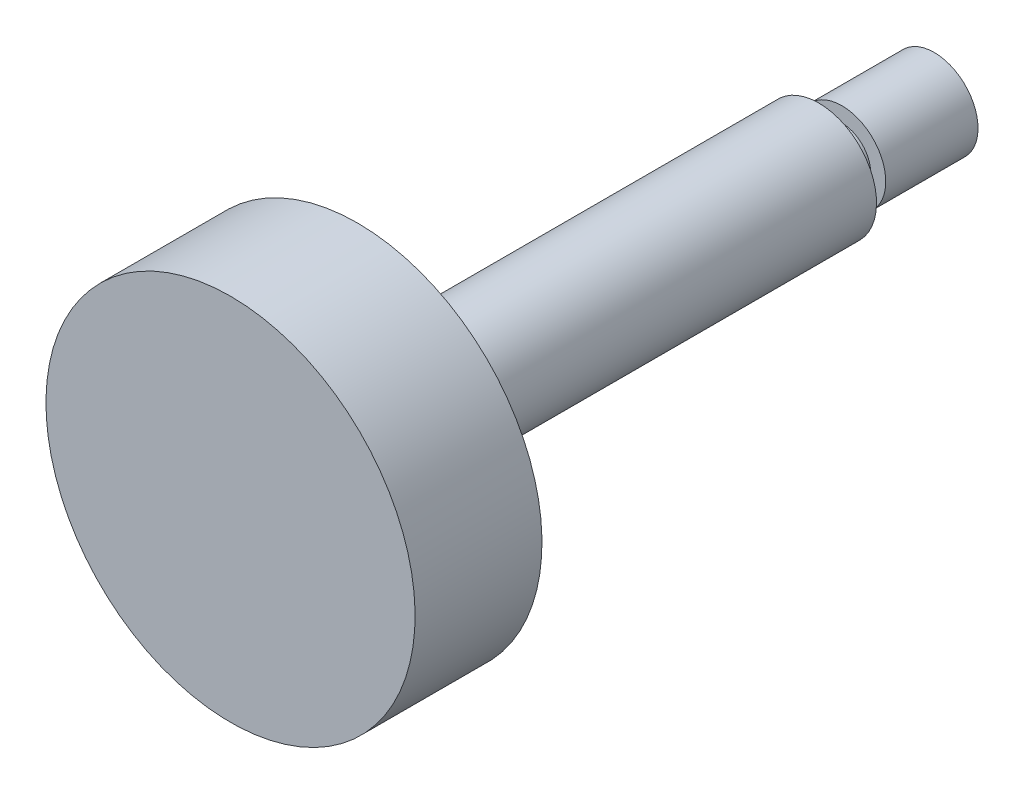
ISO-10303-21;
HEADER;
FILE_DESCRIPTION(('STEP AP214'),'2;1');
FILE_NAME('part.step','',(''),(''),'','','');
FILE_SCHEMA(('AUTOMOTIVE_DESIGN { 1 0 10303 214 1 1 1 1 }'));
ENDSEC;
DATA;
#1=APPLICATION_CONTEXT('core data for automotive mechanical design processes');
#2=APPLICATION_PROTOCOL_DEFINITION('international standard','automotive_design',2000,#1);
#3=PRODUCT_CONTEXT('',#1,'mechanical');
#4=PRODUCT('Part','Part','',(#3));
#5=PRODUCT_RELATED_PRODUCT_CATEGORY('part','',(#4));
#6=PRODUCT_DEFINITION_FORMATION('','',#4);
#7=PRODUCT_DEFINITION_CONTEXT('part definition',#1,'design');
#8=PRODUCT_DEFINITION('design','',#6,#7);
#9=PRODUCT_DEFINITION_SHAPE('','',#8);
#10=(LENGTH_UNIT() NAMED_UNIT(*) SI_UNIT(.MILLI.,.METRE.));
#11=(NAMED_UNIT(*) PLANE_ANGLE_UNIT() SI_UNIT($,.RADIAN.));
#12=(NAMED_UNIT(*) SI_UNIT($,.STERADIAN.) SOLID_ANGLE_UNIT());
#13=UNCERTAINTY_MEASURE_WITH_UNIT(LENGTH_MEASURE(1.E-05),#10,'distance_accuracy_value','');
#14=(GEOMETRIC_REPRESENTATION_CONTEXT(3) GLOBAL_UNCERTAINTY_ASSIGNED_CONTEXT((#13)) GLOBAL_UNIT_ASSIGNED_CONTEXT((#10,
#11,#12)) REPRESENTATION_CONTEXT('',''));
#15=CARTESIAN_POINT('',(0.,0.,0.));
#16=DIRECTION('',(0.,0.,1.));
#17=DIRECTION('',(1.,0.,0.));
#18=AXIS2_PLACEMENT_3D('',#15,#16,#17);
#19=CARTESIAN_POINT('',(0.,-5.,10.));
#20=DIRECTION('',(0.,0.,-1.));
#21=DIRECTION('',(0.,-1.,0.));
#22=AXIS2_PLACEMENT_3D('',#19,#20,#21);
#23=PLANE('',#22);
#24=CARTESIAN_POINT('',(0.,0.,10.));
#25=DIRECTION('',(0.,0.,1.));
#26=DIRECTION('',(0.,1.,0.));
#27=AXIS2_PLACEMENT_3D('',#24,#25,#26);
#28=CIRCLE('',#27,2.5);
#29=CARTESIAN_POINT('',(0.,2.5,10.));
#30=VERTEX_POINT('',#29);
#31=EDGE_CURVE('E40',#30,#30,#28,.T.);
#32=ORIENTED_EDGE('',*,*,#31,.T.);
#33=EDGE_LOOP('',(#32));
#34=FACE_BOUND('',#33,.T.);
#35=CARTESIAN_POINT('',(0.,0.,10.));
#36=DIRECTION('',(0.,0.,1.));
#37=DIRECTION('',(0.,1.,0.));
#38=AXIS2_PLACEMENT_3D('',#35,#36,#37);
#39=CIRCLE('',#38,5.);
#40=CARTESIAN_POINT('',(0.,5.,10.));
#41=VERTEX_POINT('',#40);
#42=EDGE_CURVE('E8',#41,#41,#39,.T.);
#43=ORIENTED_EDGE('',*,*,#42,.F.);
#44=EDGE_LOOP('',(#43));
#45=FACE_BOUND('',#44,.T.);
#46=ADVANCED_FACE('F12',(#34,#45),#23,.T.);
#47=CARTESIAN_POINT('',(0.,0.,20.));
#48=DIRECTION('',(0.,0.,1.));
#49=DIRECTION('',(0.,1.,0.));
#50=AXIS2_PLACEMENT_3D('',#47,#48,#49);
#51=CYLINDRICAL_SURFACE('',#50,5.);
#52=CARTESIAN_POINT('',(0.,0.,50.));
#53=DIRECTION('',(0.,0.,1.));
#54=DIRECTION('',(0.,1.,0.));
#55=AXIS2_PLACEMENT_3D('',#52,#53,#54);
#56=CIRCLE('',#55,5.);
#57=CARTESIAN_POINT('',(0.,5.,50.));
#58=VERTEX_POINT('',#57);
#59=EDGE_CURVE('E18',#58,#58,#56,.T.);
#60=ORIENTED_EDGE('',*,*,#59,.F.);
#61=EDGE_LOOP('',(#60));
#62=FACE_BOUND('',#61,.T.);
#63=ORIENTED_EDGE('',*,*,#42,.T.);
#64=EDGE_LOOP('',(#63));
#65=FACE_BOUND('',#64,.T.);
#66=ADVANCED_FACE('F59',(#62,#65),#51,.T.);
#67=CARTESIAN_POINT('',(0.,-16.,50.));
#68=DIRECTION('',(0.,0.,-1.));
#69=DIRECTION('',(0.,-1.,0.));
#70=AXIS2_PLACEMENT_3D('',#67,#68,#69);
#71=PLANE('',#70);
#72=ORIENTED_EDGE('',*,*,#59,.T.);
#73=EDGE_LOOP('',(#72));
#74=FACE_BOUND('',#73,.T.);
#75=CARTESIAN_POINT('',(0.,0.,50.));
#76=DIRECTION('',(0.,0.,1.));
#77=DIRECTION('',(0.,1.,0.));
#78=AXIS2_PLACEMENT_3D('',#75,#76,#77);
#79=CIRCLE('',#78,16.);
#80=CARTESIAN_POINT('',(0.,16.,50.));
#81=VERTEX_POINT('',#80);
#82=EDGE_CURVE('E22',#81,#81,#79,.T.);
#83=ORIENTED_EDGE('',*,*,#82,.F.);
#84=EDGE_LOOP('',(#83));
#85=FACE_BOUND('',#84,.T.);
#86=ADVANCED_FACE('F63',(#74,#85),#71,.T.);
#87=CARTESIAN_POINT('',(0.,0.,20.));
#88=DIRECTION('',(0.,0.,1.));
#89=DIRECTION('',(0.,1.,0.));
#90=AXIS2_PLACEMENT_3D('',#87,#88,#89);
#91=CYLINDRICAL_SURFACE('',#90,16.);
#92=CARTESIAN_POINT('',(0.,0.,61.));
#93=DIRECTION('',(0.,0.,1.));
#94=DIRECTION('',(0.,1.,0.));
#95=AXIS2_PLACEMENT_3D('',#92,#93,#94);
#96=CIRCLE('',#95,16.);
#97=CARTESIAN_POINT('',(0.,16.,61.));
#98=VERTEX_POINT('',#97);
#99=EDGE_CURVE('E26',#98,#98,#96,.T.);
#100=ORIENTED_EDGE('',*,*,#99,.F.);
#101=EDGE_LOOP('',(#100));
#102=FACE_BOUND('',#101,.T.);
#103=ORIENTED_EDGE('',*,*,#82,.T.);
#104=EDGE_LOOP('',(#103));
#105=FACE_BOUND('',#104,.T.);
#106=ADVANCED_FACE('F68',(#102,#105),#91,.T.);
#107=CARTESIAN_POINT('',(0.,-16.,61.));
#108=DIRECTION('',(0.,0.,-1.));
#109=DIRECTION('',(0.,-1.,0.));
#110=AXIS2_PLACEMENT_3D('',#107,#108,#109);
#111=PLANE('',#110);
#112=ORIENTED_EDGE('',*,*,#99,.T.);
#113=EDGE_LOOP('',(#112));
#114=FACE_BOUND('',#113,.T.);
#115=ADVANCED_FACE('F73',(#114),#111,.F.);
#116=CARTESIAN_POINT('',(0.,-3.8,0.));
#117=DIRECTION('',(0.,0.,-1.));
#118=DIRECTION('',(0.,-1.,0.));
#119=AXIS2_PLACEMENT_3D('',#116,#117,#118);
#120=PLANE('',#119);
#121=CARTESIAN_POINT('',(0.,0.,0.));
#122=DIRECTION('',(0.,0.,1.));
#123=DIRECTION('',(0.,1.,0.));
#124=AXIS2_PLACEMENT_3D('',#121,#122,#123);
#125=CIRCLE('',#124,3.8);
#126=CARTESIAN_POINT('',(0.,3.8,0.));
#127=VERTEX_POINT('',#126);
#128=EDGE_CURVE('E31',#127,#127,#125,.T.);
#129=ORIENTED_EDGE('',*,*,#128,.F.);
#130=EDGE_LOOP('',(#129));
#131=FACE_BOUND('',#130,.T.);
#132=ADVANCED_FACE('F77',(#131),#120,.T.);
#133=CARTESIAN_POINT('',(0.,0.,20.));
#134=DIRECTION('',(0.,0.,1.));
#135=DIRECTION('',(0.,1.,0.));
#136=AXIS2_PLACEMENT_3D('',#133,#134,#135);
#137=CYLINDRICAL_SURFACE('',#136,3.8);
#138=ORIENTED_EDGE('',*,*,#128,.T.);
#139=EDGE_LOOP('',(#138));
#140=FACE_BOUND('',#139,.T.);
#141=CARTESIAN_POINT('',(0.,0.,8.));
#142=DIRECTION('',(0.,0.,1.));
#143=DIRECTION('',(0.,1.,0.));
#144=AXIS2_PLACEMENT_3D('',#141,#142,#143);
#145=CIRCLE('',#144,3.8);
#146=CARTESIAN_POINT('',(0.,3.8,8.));
#147=VERTEX_POINT('',#146);
#148=EDGE_CURVE('E34',#147,#147,#145,.T.);
#149=ORIENTED_EDGE('',*,*,#148,.F.);
#150=EDGE_LOOP('',(#149));
#151=FACE_BOUND('',#150,.T.);
#152=ADVANCED_FACE('F55',(#140,#151),#137,.T.);
#153=CARTESIAN_POINT('',(0.,-2.5,8.));
#154=DIRECTION('',(0.,0.,1.));
#155=DIRECTION('',(0.,1.,0.));
#156=AXIS2_PLACEMENT_3D('',#153,#154,#155);
#157=PLANE('',#156);
#158=ORIENTED_EDGE('',*,*,#148,.T.);
#159=EDGE_LOOP('',(#158));
#160=FACE_BOUND('',#159,.T.);
#161=CARTESIAN_POINT('',(0.,0.,8.));
#162=DIRECTION('',(0.,0.,1.));
#163=DIRECTION('',(0.,1.,0.));
#164=AXIS2_PLACEMENT_3D('',#161,#162,#163);
#165=CIRCLE('',#164,2.5);
#166=CARTESIAN_POINT('',(0.,2.5,8.));
#167=VERTEX_POINT('',#166);
#168=EDGE_CURVE('E37',#167,#167,#165,.T.);
#169=ORIENTED_EDGE('',*,*,#168,.F.);
#170=EDGE_LOOP('',(#169));
#171=FACE_BOUND('',#170,.T.);
#172=ADVANCED_FACE('F48',(#160,#171),#157,.T.);
#173=CARTESIAN_POINT('',(0.,0.,20.));
#174=DIRECTION('',(0.,0.,1.));
#175=DIRECTION('',(0.,1.,0.));
#176=AXIS2_PLACEMENT_3D('',#173,#174,#175);
#177=CYLINDRICAL_SURFACE('',#176,2.5);
#178=ORIENTED_EDGE('',*,*,#168,.T.);
#179=EDGE_LOOP('',(#178));
#180=FACE_BOUND('',#179,.T.);
#181=ORIENTED_EDGE('',*,*,#31,.F.);
#182=EDGE_LOOP('',(#181));
#183=FACE_BOUND('',#182,.T.);
#184=ADVANCED_FACE('F46',(#180,#183),#177,.T.);
#185=CLOSED_SHELL('',(#46,#66,#86,#106,#115,#132,#152,#172,#184));
#186=MANIFOLD_SOLID_BREP('B1',#185);
#187=ADVANCED_BREP_SHAPE_REPRESENTATION('',(#18,#186),#14);
#188=SHAPE_DEFINITION_REPRESENTATION(#9,#187);
ENDSEC;
END-ISO-10303-21;
